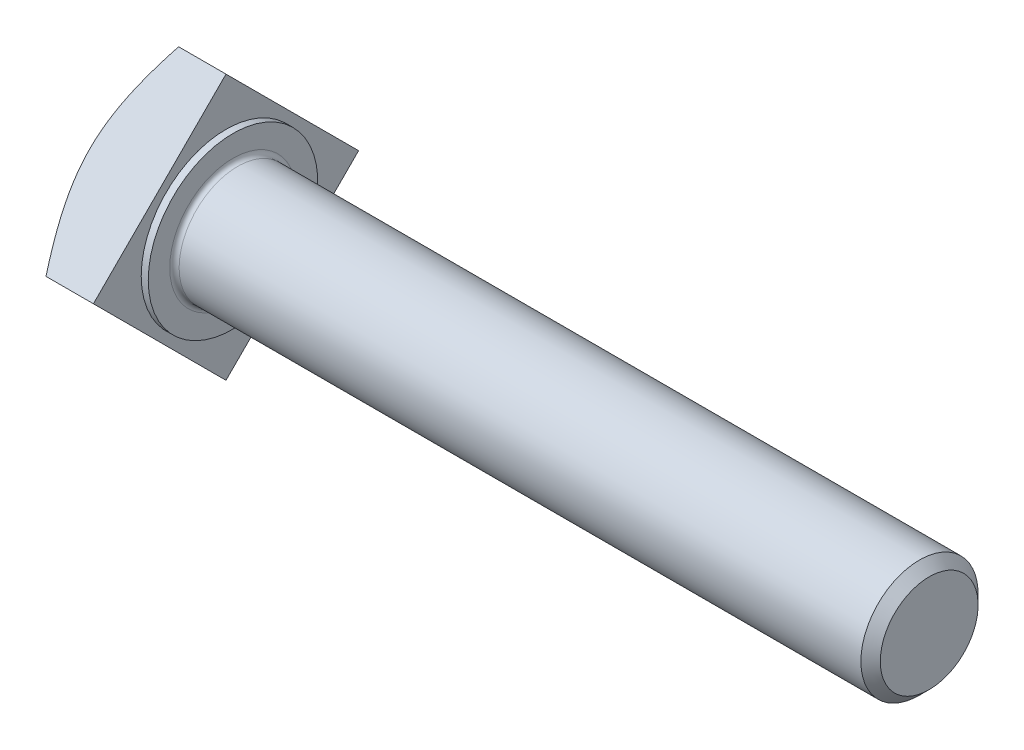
ISO-10303-21;
HEADER;
FILE_DESCRIPTION(('STEP AP214'),'2;1');
FILE_NAME('part.step','',(''),(''),'','','');
FILE_SCHEMA(('AUTOMOTIVE_DESIGN { 1 0 10303 214 1 1 1 1 }'));
ENDSEC;
DATA;
#1=APPLICATION_CONTEXT('core data for automotive mechanical design processes');
#2=APPLICATION_PROTOCOL_DEFINITION('international standard','automotive_design',2000,#1);
#3=PRODUCT_CONTEXT('',#1,'mechanical');
#4=PRODUCT('Part','Part','',(#3));
#5=PRODUCT_RELATED_PRODUCT_CATEGORY('part','',(#4));
#6=PRODUCT_DEFINITION_FORMATION('','',#4);
#7=PRODUCT_DEFINITION_CONTEXT('part definition',#1,'design');
#8=PRODUCT_DEFINITION('design','',#6,#7);
#9=PRODUCT_DEFINITION_SHAPE('','',#8);
#10=(LENGTH_UNIT() NAMED_UNIT(*) SI_UNIT(.MILLI.,.METRE.));
#11=(NAMED_UNIT(*) PLANE_ANGLE_UNIT() SI_UNIT($,.RADIAN.));
#12=(NAMED_UNIT(*) SI_UNIT($,.STERADIAN.) SOLID_ANGLE_UNIT());
#13=UNCERTAINTY_MEASURE_WITH_UNIT(LENGTH_MEASURE(1.E-05),#10,'distance_accuracy_value','');
#14=(GEOMETRIC_REPRESENTATION_CONTEXT(3) GLOBAL_UNCERTAINTY_ASSIGNED_CONTEXT((#13)) GLOBAL_UNIT_ASSIGNED_CONTEXT((#10,
#11,#12)) REPRESENTATION_CONTEXT('',''));
#15=CARTESIAN_POINT('',(0.,0.,0.));
#16=DIRECTION('',(0.,0.,1.));
#17=DIRECTION('',(1.,0.,0.));
#18=AXIS2_PLACEMENT_3D('',#15,#16,#17);
#19=CARTESIAN_POINT('',(6.4,0.,11.3137084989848));
#20=DIRECTION('',(0.,-0.707106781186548,-0.707106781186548));
#21=DIRECTION('',(0.,0.707106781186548,-0.707106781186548));
#22=AXIS2_PLACEMENT_3D('',#19,#20,#21);
#23=PLANE('',#22);
#24=CARTESIAN_POINT('',(2.35495892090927,-0.00020000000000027,11.3139084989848));
#25=CARTESIAN_POINT('',(2.24393651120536,0.192162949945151,11.1215455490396));
#26=CARTESIAN_POINT('',(2.13526682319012,0.385220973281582,10.9284875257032));
#27=CARTESIAN_POINT('',(1.92374625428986,0.772998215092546,10.5407102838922));
#28=CARTESIAN_POINT('',(1.82089740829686,0.967717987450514,10.3459905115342));
#29=CARTESIAN_POINT('',(1.62159774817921,1.36016323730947,9.95354526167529));
#30=CARTESIAN_POINT('',(1.52519032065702,1.55789984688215,9.75580865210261));
#31=CARTESIAN_POINT('',(1.34099203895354,1.95533199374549,9.35837650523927));
#32=CARTESIAN_POINT('',(1.25320045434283,2.15502736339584,9.15868113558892));
#33=CARTESIAN_POINT('',(1.00810307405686,2.75061455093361,8.56309394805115));
#34=CARTESIAN_POINT('',(0.865546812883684,3.14972873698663,8.16397976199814));
#35=CARTESIAN_POINT('',(0.693593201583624,3.75386257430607,7.5598459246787));
#36=CARTESIAN_POINT('',(0.643286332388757,3.95593629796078,7.35777220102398));
#37=CARTESIAN_POINT('',(0.558470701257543,4.36175045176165,6.95195804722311));
#38=CARTESIAN_POINT('',(0.523960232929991,4.56549069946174,6.74821779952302));
#39=CARTESIAN_POINT('',(0.476493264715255,4.94072498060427,6.37298351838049));
#40=CARTESIAN_POINT('',(0.460938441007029,5.11205554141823,6.20165295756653));
#41=CARTESIAN_POINT('',(0.442499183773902,5.45505842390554,5.85865007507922));
#42=CARTESIAN_POINT('',(0.439614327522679,5.62673073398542,5.68697776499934));
#43=CARTESIAN_POINT('',(0.446621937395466,5.97001902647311,5.34368947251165));
#44=CARTESIAN_POINT('',(0.456520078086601,6.14163495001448,5.17207354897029));
#45=CARTESIAN_POINT('',(0.488751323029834,6.48427842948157,4.82943006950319));
#46=CARTESIAN_POINT('',(0.511084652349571,6.65530597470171,4.65840252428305));
#47=CARTESIAN_POINT('',(0.567490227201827,6.99667442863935,4.31703407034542));
#48=CARTESIAN_POINT('',(0.601582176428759,7.1670136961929,4.14669480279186));
#49=CARTESIAN_POINT('',(0.680479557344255,7.50645646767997,3.80725203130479));
#50=CARTESIAN_POINT('',(0.725286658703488,7.67555977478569,3.63814872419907));
#51=CARTESIAN_POINT('',(0.874030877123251,8.18074931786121,3.13295918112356));
#52=CARTESIAN_POINT('',(0.992296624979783,8.5147472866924,2.79896121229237));
#53=CARTESIAN_POINT('',(1.20941634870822,9.05626009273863,2.25744840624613));
#54=CARTESIAN_POINT('',(1.29967273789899,9.26557235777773,2.04813614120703));
#55=CARTESIAN_POINT('',(1.48982262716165,9.68193413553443,1.63177436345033));
#56=CARTESIAN_POINT('',(1.58971323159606,9.88898430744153,1.42472419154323));
#57=CARTESIAN_POINT('',(1.79686148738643,10.3000125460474,1.01369595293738));
#58=CARTESIAN_POINT('',(1.90407852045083,10.5040009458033,0.809707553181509));
#59=CARTESIAN_POINT('',(2.12499302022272,10.9102169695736,0.403491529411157));
#60=CARTESIAN_POINT('',(2.2386904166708,11.1124446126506,0.201263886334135));
#61=CARTESIAN_POINT('',(2.35495892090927,11.3139084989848,-0.000199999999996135));
#62=B_SPLINE_CURVE_WITH_KNOTS('',3,(#24,#25,#26,#27,#28,#29,#30,#31,#32,#33,#34,#35,#36,#37,#38,
#39,#40,#41,#42,#43,#44,#45,#46,#47,#48,#49,#50,#51,#52,#53,#54,#55,#56,#57,#58,#59,#60,#61),
.UNSPECIFIED.,.F.,.F.,(4,2,2,2,2,2,2,2,2,2,2,2,2,2,2,2,2,2,4),(0.,0.881492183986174,
1.76329064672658,2.65052927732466,3.5376926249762,5.2816520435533,6.15180959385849,
7.02187312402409,7.74995274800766,8.47800807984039,9.20638671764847,9.9347785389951,
10.6643968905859,11.3941290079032,12.8534563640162,13.7817257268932,14.709716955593,
15.6329258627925,16.5561247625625),.UNSPECIFIED.);
#63=CARTESIAN_POINT('',(2.35484344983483,0.,11.3137084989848));
#64=VERTEX_POINT('',#63);
#65=CARTESIAN_POINT('',(2.35484344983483,11.3137084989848,0.));
#66=VERTEX_POINT('',#65);
#67=EDGE_CURVE('E48',#64,#66,#62,.T.);
#68=ORIENTED_EDGE('',*,*,#67,.F.);
#69=DIRECTION('',(-1.,0.,0.));
#70=VECTOR('',#69,1.);
#71=CARTESIAN_POINT('',(6.4,0.,11.3137084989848));
#72=LINE('',#71,#70);
#73=CARTESIAN_POINT('',(6.4,0.,11.3137084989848));
#74=VERTEX_POINT('',#73);
#75=EDGE_CURVE('E86',#74,#64,#72,.T.);
#76=ORIENTED_EDGE('',*,*,#75,.F.);
#77=DIRECTION('',(0.,-0.707106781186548,0.707106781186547));
#78=VECTOR('',#77,1.);
#79=CARTESIAN_POINT('',(6.4,0.,11.3137084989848));
#80=LINE('',#79,#78);
#81=CARTESIAN_POINT('',(6.4,11.3137084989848,0.));
#82=VERTEX_POINT('',#81);
#83=EDGE_CURVE('E105',#82,#74,#80,.T.);
#84=ORIENTED_EDGE('',*,*,#83,.F.);
#85=DIRECTION('',(-1.,0.,0.));
#86=VECTOR('',#85,1.);
#87=CARTESIAN_POINT('',(6.4,11.3137084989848,0.));
#88=LINE('',#87,#86);
#89=EDGE_CURVE('E87',#82,#66,#88,.T.);
#90=ORIENTED_EDGE('',*,*,#89,.T.);
#91=EDGE_LOOP('',(#68,#76,#84,#90));
#92=FACE_BOUND('',#91,.T.);
#93=ADVANCED_FACE('F33',(#92),#23,.F.);
#94=CARTESIAN_POINT('',(6.4,-11.3137084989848,0.));
#95=DIRECTION('',(0.,0.707106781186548,-0.707106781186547));
#96=DIRECTION('',(0.,0.707106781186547,0.707106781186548));
#97=AXIS2_PLACEMENT_3D('',#94,#95,#96);
#98=PLANE('',#97);
#99=CARTESIAN_POINT('',(2.35495892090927,-11.3139084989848,-0.000200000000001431));
#100=CARTESIAN_POINT('',(2.24393651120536,-11.1215455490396,0.19216294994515));
#101=CARTESIAN_POINT('',(2.13526682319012,-10.9284875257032,0.385220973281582));
#102=CARTESIAN_POINT('',(1.92374625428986,-10.5407102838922,0.772998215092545));
#103=CARTESIAN_POINT('',(1.82089740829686,-10.3459905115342,0.967717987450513));
#104=CARTESIAN_POINT('',(1.62159774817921,-9.95354526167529,1.36016323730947));
#105=CARTESIAN_POINT('',(1.52519032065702,-9.75580865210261,1.55789984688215));
#106=CARTESIAN_POINT('',(1.34099203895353,-9.35837650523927,1.95533199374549));
#107=CARTESIAN_POINT('',(1.25320045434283,-9.15868113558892,2.15502736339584));
#108=CARTESIAN_POINT('',(1.00810307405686,-8.56309394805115,2.75061455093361));
#109=CARTESIAN_POINT('',(0.865546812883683,-8.16397976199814,3.14972873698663));
#110=CARTESIAN_POINT('',(0.693593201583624,-7.5598459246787,3.75386257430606));
#111=CARTESIAN_POINT('',(0.643286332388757,-7.35777220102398,3.95593629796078));
#112=CARTESIAN_POINT('',(0.558470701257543,-6.95195804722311,4.36175045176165));
#113=CARTESIAN_POINT('',(0.523960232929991,-6.74821779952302,4.56549069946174));
#114=CARTESIAN_POINT('',(0.476493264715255,-6.37298351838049,4.94072498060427));
#115=CARTESIAN_POINT('',(0.460938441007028,-6.20165295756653,5.11205554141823));
#116=CARTESIAN_POINT('',(0.4424991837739,-5.85865007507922,5.45505842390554));
#117=CARTESIAN_POINT('',(0.439614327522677,-5.68697776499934,5.62673073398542));
#118=CARTESIAN_POINT('',(0.446621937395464,-5.34368947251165,5.97001902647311));
#119=CARTESIAN_POINT('',(0.4565200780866,-5.17207354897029,6.14163495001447));
#120=CARTESIAN_POINT('',(0.488751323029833,-4.82943006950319,6.48427842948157));
#121=CARTESIAN_POINT('',(0.51108465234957,-4.65840252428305,6.65530597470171));
#122=CARTESIAN_POINT('',(0.567490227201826,-4.31703407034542,6.99667442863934));
#123=CARTESIAN_POINT('',(0.601582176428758,-4.14669480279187,7.1670136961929));
#124=CARTESIAN_POINT('',(0.680479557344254,-3.80725203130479,7.50645646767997));
#125=CARTESIAN_POINT('',(0.725286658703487,-3.63814872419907,7.67555977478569));
#126=CARTESIAN_POINT('',(0.874030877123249,-3.13295918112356,8.1807493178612));
#127=CARTESIAN_POINT('',(0.992296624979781,-2.79896121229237,8.51474728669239));
#128=CARTESIAN_POINT('',(1.20941634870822,-2.25744840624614,9.05626009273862));
#129=CARTESIAN_POINT('',(1.29967273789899,-2.04813614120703,9.26557235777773));
#130=CARTESIAN_POINT('',(1.48982262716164,-1.63177436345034,9.68193413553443));
#131=CARTESIAN_POINT('',(1.58971323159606,-1.42472419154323,9.88898430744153));
#132=CARTESIAN_POINT('',(1.79686148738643,-1.01369595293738,10.3000125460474));
#133=CARTESIAN_POINT('',(1.90407852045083,-0.809707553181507,10.5040009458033));
#134=CARTESIAN_POINT('',(2.12499302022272,-0.403491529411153,10.9102169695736));
#135=CARTESIAN_POINT('',(2.2386904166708,-0.201263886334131,11.1124446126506));
#136=CARTESIAN_POINT('',(2.35495892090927,0.000200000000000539,11.3139084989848));
#137=B_SPLINE_CURVE_WITH_KNOTS('',3,(#99,#100,#101,#102,#103,#104,#105,#106,#107,#108,#109,#110,
#111,#112,#113,#114,#115,#116,#117,#118,#119,#120,#121,#122,#123,#124,#125,#126,#127,#128,#129,
#130,#131,#132,#133,#134,#135,#136),.UNSPECIFIED.,.F.,.F.,(4,2,2,2,2,2,2,2,2,2,2,2,2,2,2,2,2,2,
4),(0.,0.881492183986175,1.76329064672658,2.65052927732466,3.5376926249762,5.28165204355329,
6.15180959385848,7.02187312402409,7.74995274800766,8.47800807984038,9.20638671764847,
9.93477853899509,10.6643968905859,11.3941290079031,12.8534563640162,13.7817257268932,
14.709716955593,15.6329258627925,16.5561247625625),.UNSPECIFIED.);
#138=CARTESIAN_POINT('',(2.35484344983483,-11.3137084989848,0.));
#139=VERTEX_POINT('',#138);
#140=EDGE_CURVE('E73',#139,#64,#137,.T.);
#141=ORIENTED_EDGE('',*,*,#140,.F.);
#142=DIRECTION('',(-1.,0.,0.));
#143=VECTOR('',#142,1.);
#144=CARTESIAN_POINT('',(6.4,-11.3137084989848,0.));
#145=LINE('',#144,#143);
#146=CARTESIAN_POINT('',(6.4,-11.3137084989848,0.));
#147=VERTEX_POINT('',#146);
#148=EDGE_CURVE('E92',#147,#139,#145,.T.);
#149=ORIENTED_EDGE('',*,*,#148,.F.);
#150=DIRECTION('',(0.,-0.707106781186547,-0.707106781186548));
#151=VECTOR('',#150,1.);
#152=CARTESIAN_POINT('',(6.4,-11.3137084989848,0.));
#153=LINE('',#152,#151);
#154=EDGE_CURVE('E91',#74,#147,#153,.T.);
#155=ORIENTED_EDGE('',*,*,#154,.F.);
#156=ORIENTED_EDGE('',*,*,#75,.T.);
#157=EDGE_LOOP('',(#141,#149,#155,#156));
#158=FACE_BOUND('',#157,.T.);
#159=ADVANCED_FACE('F90',(#158),#98,.F.);
#160=CARTESIAN_POINT('',(6.4,0.,-11.3137084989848));
#161=DIRECTION('',(0.,0.707106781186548,0.707106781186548));
#162=DIRECTION('',(0.,-0.707106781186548,0.707106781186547));
#163=AXIS2_PLACEMENT_3D('',#160,#161,#162);
#164=PLANE('',#163);
#165=CARTESIAN_POINT('',(2.35495892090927,0.000200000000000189,-11.3139084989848));
#166=CARTESIAN_POINT('',(2.24393651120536,-0.192162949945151,-11.1215455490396));
#167=CARTESIAN_POINT('',(2.13526682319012,-0.385220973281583,-10.9284875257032));
#168=CARTESIAN_POINT('',(1.92374625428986,-0.772998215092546,-10.5407102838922));
#169=CARTESIAN_POINT('',(1.82089740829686,-0.967717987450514,-10.3459905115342));
#170=CARTESIAN_POINT('',(1.62159774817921,-1.36016323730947,-9.95354526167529));
#171=CARTESIAN_POINT('',(1.52519032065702,-1.55789984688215,-9.75580865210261));
#172=CARTESIAN_POINT('',(1.34099203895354,-1.95533199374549,-9.35837650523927));
#173=CARTESIAN_POINT('',(1.25320045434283,-2.15502736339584,-9.15868113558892));
#174=CARTESIAN_POINT('',(1.00810307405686,-2.75061455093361,-8.56309394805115));
#175=CARTESIAN_POINT('',(0.865546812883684,-3.14972873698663,-8.16397976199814));
#176=CARTESIAN_POINT('',(0.693593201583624,-3.75386257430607,-7.5598459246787));
#177=CARTESIAN_POINT('',(0.643286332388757,-3.95593629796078,-7.35777220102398));
#178=CARTESIAN_POINT('',(0.558470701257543,-4.36175045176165,-6.95195804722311));
#179=CARTESIAN_POINT('',(0.523960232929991,-4.56549069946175,-6.74821779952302));
#180=CARTESIAN_POINT('',(0.476493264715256,-4.94072498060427,-6.37298351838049));
#181=CARTESIAN_POINT('',(0.460938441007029,-5.11205554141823,-6.20165295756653));
#182=CARTESIAN_POINT('',(0.442499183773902,-5.45505842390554,-5.85865007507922));
#183=CARTESIAN_POINT('',(0.439614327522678,-5.62673073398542,-5.68697776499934));
#184=CARTESIAN_POINT('',(0.446621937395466,-5.97001902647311,-5.34368947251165));
#185=CARTESIAN_POINT('',(0.456520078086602,-6.14163495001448,-5.17207354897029));
#186=CARTESIAN_POINT('',(0.488751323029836,-6.48427842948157,-4.82943006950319));
#187=CARTESIAN_POINT('',(0.511084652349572,-6.65530597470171,-4.65840252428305));
#188=CARTESIAN_POINT('',(0.567490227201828,-6.99667442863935,-4.31703407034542));
#189=CARTESIAN_POINT('',(0.60158217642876,-7.1670136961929,-4.14669480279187));
#190=CARTESIAN_POINT('',(0.680479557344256,-7.50645646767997,-3.80725203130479));
#191=CARTESIAN_POINT('',(0.725286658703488,-7.67555977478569,-3.63814872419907));
#192=CARTESIAN_POINT('',(0.87403087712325,-8.18074931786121,-3.13295918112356));
#193=CARTESIAN_POINT('',(0.992296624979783,-8.5147472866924,-2.79896121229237));
#194=CARTESIAN_POINT('',(1.20941634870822,-9.05626009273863,-2.25744840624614));
#195=CARTESIAN_POINT('',(1.29967273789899,-9.26557235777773,-2.04813614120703));
#196=CARTESIAN_POINT('',(1.48982262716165,-9.68193413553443,-1.63177436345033));
#197=CARTESIAN_POINT('',(1.58971323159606,-9.88898430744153,-1.42472419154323));
#198=CARTESIAN_POINT('',(1.79686148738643,-10.3000125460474,-1.01369595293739));
#199=CARTESIAN_POINT('',(1.90407852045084,-10.5040009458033,-0.80970755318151));
#200=CARTESIAN_POINT('',(2.12499302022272,-10.9102169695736,-0.403491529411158));
#201=CARTESIAN_POINT('',(2.2386904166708,-11.1124446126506,-0.201263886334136));
#202=CARTESIAN_POINT('',(2.35495892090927,-11.3139084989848,0.000199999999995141));
#203=B_SPLINE_CURVE_WITH_KNOTS('',3,(#165,#166,#167,#168,#169,#170,#171,#172,#173,#174,#175,
#176,#177,#178,#179,#180,#181,#182,#183,#184,#185,#186,#187,#188,#189,#190,#191,#192,#193,#194,
#195,#196,#197,#198,#199,#200,#201,#202),.UNSPECIFIED.,.F.,.F.,(4,2,2,2,2,2,2,2,2,2,2,2,2,2,2,2,
2,2,4),(0.,0.881492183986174,1.76329064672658,2.65052927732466,3.5376926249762,5.2816520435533,
6.15180959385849,7.02187312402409,7.74995274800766,8.47800807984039,9.20638671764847,
9.9347785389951,10.6643968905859,11.3941290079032,12.8534563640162,13.7817257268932,
14.709716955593,15.6329258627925,16.5561247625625),.UNSPECIFIED.);
#204=CARTESIAN_POINT('',(2.35484344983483,0.,-11.3137084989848));
#205=VERTEX_POINT('',#204);
#206=EDGE_CURVE('E76',#205,#139,#203,.T.);
#207=ORIENTED_EDGE('',*,*,#206,.F.);
#208=DIRECTION('',(-1.,0.,0.));
#209=VECTOR('',#208,1.);
#210=CARTESIAN_POINT('',(6.4,0.,-11.3137084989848));
#211=LINE('',#210,#209);
#212=CARTESIAN_POINT('',(6.4,0.,-11.3137084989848));
#213=VERTEX_POINT('',#212);
#214=EDGE_CURVE('E95',#213,#205,#211,.T.);
#215=ORIENTED_EDGE('',*,*,#214,.F.);
#216=DIRECTION('',(0.,0.707106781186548,-0.707106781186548));
#217=VECTOR('',#216,1.);
#218=CARTESIAN_POINT('',(6.4,0.,-11.3137084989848));
#219=LINE('',#218,#217);
#220=EDGE_CURVE('E102',#147,#213,#219,.T.);
#221=ORIENTED_EDGE('',*,*,#220,.F.);
#222=ORIENTED_EDGE('',*,*,#148,.T.);
#223=EDGE_LOOP('',(#207,#215,#221,#222));
#224=FACE_BOUND('',#223,.T.);
#225=ADVANCED_FACE('F148',(#224),#164,.F.);
#226=CARTESIAN_POINT('',(6.4,11.3137084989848,0.));
#227=DIRECTION('',(0.,-0.707106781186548,0.707106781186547));
#228=DIRECTION('',(0.,-0.707106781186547,-0.707106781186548));
#229=AXIS2_PLACEMENT_3D('',#226,#227,#228);
#230=PLANE('',#229);
#231=CARTESIAN_POINT('',(2.35495892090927,11.3139084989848,0.000200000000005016));
#232=CARTESIAN_POINT('',(2.24393651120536,11.1215455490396,-0.192162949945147));
#233=CARTESIAN_POINT('',(2.13526682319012,10.9284875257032,-0.385220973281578));
#234=CARTESIAN_POINT('',(1.92374625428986,10.5407102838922,-0.772998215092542));
#235=CARTESIAN_POINT('',(1.82089740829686,10.3459905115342,-0.96771798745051));
#236=CARTESIAN_POINT('',(1.62159774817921,9.95354526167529,-1.36016323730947));
#237=CARTESIAN_POINT('',(1.52519032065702,9.75580865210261,-1.55789984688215));
#238=CARTESIAN_POINT('',(1.34099203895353,9.35837650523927,-1.95533199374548));
#239=CARTESIAN_POINT('',(1.25320045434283,9.15868113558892,-2.15502736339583));
#240=CARTESIAN_POINT('',(1.00810307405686,8.56309394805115,-2.75061455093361));
#241=CARTESIAN_POINT('',(0.865546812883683,8.16397976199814,-3.14972873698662));
#242=CARTESIAN_POINT('',(0.693593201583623,7.5598459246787,-3.75386257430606));
#243=CARTESIAN_POINT('',(0.643286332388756,7.35777220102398,-3.95593629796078));
#244=CARTESIAN_POINT('',(0.558470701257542,6.95195804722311,-4.36175045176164));
#245=CARTESIAN_POINT('',(0.52396023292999,6.74821779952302,-4.56549069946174));
#246=CARTESIAN_POINT('',(0.476493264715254,6.37298351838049,-4.94072498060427));
#247=CARTESIAN_POINT('',(0.460938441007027,6.20165295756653,-5.11205554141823));
#248=CARTESIAN_POINT('',(0.4424991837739,5.85865007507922,-5.45505842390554));
#249=CARTESIAN_POINT('',(0.439614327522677,5.68697776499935,-5.62673073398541));
#250=CARTESIAN_POINT('',(0.446621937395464,5.34368947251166,-5.9700190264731));
#251=CARTESIAN_POINT('',(0.456520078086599,5.17207354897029,-6.14163495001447));
#252=CARTESIAN_POINT('',(0.488751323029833,4.8294300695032,-6.48427842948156));
#253=CARTESIAN_POINT('',(0.511084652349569,4.65840252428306,-6.6553059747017));
#254=CARTESIAN_POINT('',(0.567490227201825,4.31703407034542,-6.99667442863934));
#255=CARTESIAN_POINT('',(0.601582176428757,4.14669480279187,-7.16701369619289));
#256=CARTESIAN_POINT('',(0.680479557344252,3.80725203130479,-7.50645646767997));
#257=CARTESIAN_POINT('',(0.725286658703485,3.63814872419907,-7.67555977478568));
#258=CARTESIAN_POINT('',(0.874030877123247,3.13295918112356,-8.1807493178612));
#259=CARTESIAN_POINT('',(0.992296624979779,2.79896121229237,-8.51474728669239));
#260=CARTESIAN_POINT('',(1.20941634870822,2.25744840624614,-9.05626009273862));
#261=CARTESIAN_POINT('',(1.29967273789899,2.04813614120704,-9.26557235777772));
#262=CARTESIAN_POINT('',(1.48982262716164,1.63177436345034,-9.68193413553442));
#263=CARTESIAN_POINT('',(1.58971323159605,1.42472419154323,-9.88898430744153));
#264=CARTESIAN_POINT('',(1.79686148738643,1.01369595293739,-10.3000125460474));
#265=CARTESIAN_POINT('',(1.90407852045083,0.80970755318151,-10.5040009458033));
#266=CARTESIAN_POINT('',(2.12499302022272,0.403491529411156,-10.9102169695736));
#267=CARTESIAN_POINT('',(2.2386904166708,0.201263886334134,-11.1124446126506));
#268=CARTESIAN_POINT('',(2.35495892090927,-0.000199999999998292,-11.3139084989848));
#269=B_SPLINE_CURVE_WITH_KNOTS('',3,(#231,#232,#233,#234,#235,#236,#237,#238,#239,#240,#241,
#242,#243,#244,#245,#246,#247,#248,#249,#250,#251,#252,#253,#254,#255,#256,#257,#258,#259,#260,
#261,#262,#263,#264,#265,#266,#267,#268),.UNSPECIFIED.,.F.,.F.,(4,2,2,2,2,2,2,2,2,2,2,2,2,2,2,2,
2,2,4),(0.,0.881492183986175,1.76329064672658,2.65052927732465,3.5376926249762,5.28165204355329,
6.15180959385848,7.02187312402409,7.74995274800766,8.47800807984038,9.20638671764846,
9.93477853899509,10.6643968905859,11.3941290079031,12.8534563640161,13.7817257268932,
14.709716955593,15.6329258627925,16.5561247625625),.UNSPECIFIED.);
#270=EDGE_CURVE('E137',#66,#205,#269,.T.);
#271=ORIENTED_EDGE('',*,*,#270,.F.);
#272=ORIENTED_EDGE('',*,*,#89,.F.);
#273=DIRECTION('',(0.,0.707106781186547,0.707106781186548));
#274=VECTOR('',#273,1.);
#275=CARTESIAN_POINT('',(6.4,11.3137084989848,0.));
#276=LINE('',#275,#274);
#277=EDGE_CURVE('E56',#213,#82,#276,.T.);
#278=ORIENTED_EDGE('',*,*,#277,.F.);
#279=ORIENTED_EDGE('',*,*,#214,.T.);
#280=EDGE_LOOP('',(#271,#272,#278,#279));
#281=FACE_BOUND('',#280,.T.);
#282=ADVANCED_FACE('F151',(#281),#230,.F.);
#283=CARTESIAN_POINT('',(6.4,0.,11.3137084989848));
#284=DIRECTION('',(1.,0.,0.));
#285=DIRECTION('',(0.,0.,-1.));
#286=AXIS2_PLACEMENT_3D('',#283,#284,#285);
#287=PLANE('',#286);
#288=ORIENTED_EDGE('',*,*,#83,.T.);
#289=ORIENTED_EDGE('',*,*,#154,.T.);
#290=ORIENTED_EDGE('',*,*,#220,.T.);
#291=ORIENTED_EDGE('',*,*,#277,.T.);
#292=EDGE_LOOP('',(#288,#289,#290,#291));
#293=FACE_BOUND('',#292,.T.);
#294=CARTESIAN_POINT('',(6.4,0.,0.));
#295=DIRECTION('',(-1.,0.,0.));
#296=DIRECTION('',(0.,0.,1.));
#297=AXIS2_PLACEMENT_3D('',#294,#295,#296);
#298=CIRCLE('',#297,7.235);
#299=CARTESIAN_POINT('',(6.4,0.,7.235));
#300=VERTEX_POINT('',#299);
#301=EDGE_CURVE('E107',#300,#300,#298,.T.);
#302=ORIENTED_EDGE('',*,*,#301,.T.);
#303=EDGE_LOOP('',(#302));
#304=FACE_BOUND('',#303,.T.);
#305=ADVANCED_FACE('F187',(#293,#304),#287,.T.);
#306=CARTESIAN_POINT('',(0.,0.,0.));
#307=DIRECTION('',(-1.,0.,0.));
#308=DIRECTION('',(0.,0.,1.));
#309=AXIS2_PLACEMENT_3D('',#306,#307,#308);
#310=CYLINDRICAL_SURFACE('',#309,7.235);
#311=ORIENTED_EDGE('',*,*,#301,.F.);
#312=EDGE_LOOP('',(#311));
#313=FACE_BOUND('',#312,.T.);
#314=CARTESIAN_POINT('',(7.,0.,0.));
#315=DIRECTION('',(-1.,0.,0.));
#316=DIRECTION('',(0.,0.,1.));
#317=AXIS2_PLACEMENT_3D('',#314,#315,#316);
#318=CIRCLE('',#317,7.235);
#319=CARTESIAN_POINT('',(7.,0.,7.235));
#320=VERTEX_POINT('',#319);
#321=EDGE_CURVE('E110',#320,#320,#318,.T.);
#322=ORIENTED_EDGE('',*,*,#321,.T.);
#323=EDGE_LOOP('',(#322));
#324=FACE_BOUND('',#323,.T.);
#325=ADVANCED_FACE('F239',(#313,#324),#310,.T.);
#326=CARTESIAN_POINT('',(7.,7.235,0.));
#327=DIRECTION('',(-1.,0.,0.));
#328=DIRECTION('',(0.,0.,1.));
#329=AXIS2_PLACEMENT_3D('',#326,#327,#328);
#330=PLANE('',#329);
#331=CARTESIAN_POINT('',(7.,0.,0.));
#332=DIRECTION('',(-1.,0.,0.));
#333=DIRECTION('',(0.,0.,1.));
#334=AXIS2_PLACEMENT_3D('',#331,#332,#333);
#335=CIRCLE('',#334,5.4);
#336=CARTESIAN_POINT('',(7.,0.,5.4));
#337=VERTEX_POINT('',#336);
#338=EDGE_CURVE('E41',#337,#337,#335,.T.);
#339=ORIENTED_EDGE('',*,*,#338,.T.);
#340=EDGE_LOOP('',(#339));
#341=FACE_BOUND('',#340,.T.);
#342=ORIENTED_EDGE('',*,*,#321,.F.);
#343=EDGE_LOOP('',(#342));
#344=FACE_BOUND('',#343,.T.);
#345=ADVANCED_FACE('F231',(#341,#344),#330,.F.);
#346=CARTESIAN_POINT('',(0.,0.,0.));
#347=DIRECTION('',(-1.,0.,0.));
#348=DIRECTION('',(0.,0.,1.));
#349=AXIS2_PLACEMENT_3D('',#346,#347,#348);
#350=CYLINDRICAL_SURFACE('',#349,5.);
#351=CARTESIAN_POINT('',(7.4,0.,0.));
#352=DIRECTION('',(-1.,0.,0.));
#353=DIRECTION('',(0.,0.,1.));
#354=AXIS2_PLACEMENT_3D('',#351,#352,#353);
#355=CIRCLE('',#354,5.);
#356=CARTESIAN_POINT('',(7.4,0.,5.));
#357=VERTEX_POINT('',#356);
#358=EDGE_CURVE('E11',#357,#357,#355,.F.);
#359=ORIENTED_EDGE('',*,*,#358,.T.);
#360=EDGE_LOOP('',(#359));
#361=FACE_BOUND('',#360,.T.);
#362=CARTESIAN_POINT('',(65.572,0.,0.));
#363=DIRECTION('',(-1.,0.,0.));
#364=DIRECTION('',(0.,0.,1.));
#365=AXIS2_PLACEMENT_3D('',#362,#363,#364);
#366=CIRCLE('',#365,5.);
#367=CARTESIAN_POINT('',(65.572,0.,5.));
#368=VERTEX_POINT('',#367);
#369=EDGE_CURVE('E113',#368,#368,#366,.T.);
#370=ORIENTED_EDGE('',*,*,#369,.T.);
#371=EDGE_LOOP('',(#370));
#372=FACE_BOUND('',#371,.T.);
#373=ADVANCED_FACE('F223',(#361,#372),#350,.T.);
#374=CARTESIAN_POINT('',(66.4,0.,0.));
#375=DIRECTION('',(-1.,0.,0.));
#376=DIRECTION('',(0.,0.,1.));
#377=AXIS2_PLACEMENT_3D('',#374,#375,#376);
#378=CONICAL_SURFACE('',#377,4.172,0.785398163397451);
#379=ORIENTED_EDGE('',*,*,#369,.F.);
#380=EDGE_LOOP('',(#379));
#381=FACE_BOUND('',#380,.T.);
#382=CARTESIAN_POINT('',(66.4,0.,0.));
#383=DIRECTION('',(-1.,0.,0.));
#384=DIRECTION('',(0.,0.,1.));
#385=AXIS2_PLACEMENT_3D('',#382,#383,#384);
#386=CIRCLE('',#385,4.172);
#387=CARTESIAN_POINT('',(66.4,0.,4.172));
#388=VERTEX_POINT('',#387);
#389=EDGE_CURVE('E88',#388,#388,#386,.T.);
#390=ORIENTED_EDGE('',*,*,#389,.T.);
#391=EDGE_LOOP('',(#390));
#392=FACE_BOUND('',#391,.T.);
#393=ADVANCED_FACE('F214',(#381,#392),#378,.T.);
#394=CARTESIAN_POINT('',(66.4,4.172,0.));
#395=DIRECTION('',(-1.,0.,0.));
#396=DIRECTION('',(0.,0.,1.));
#397=AXIS2_PLACEMENT_3D('',#394,#395,#396);
#398=PLANE('',#397);
#399=ORIENTED_EDGE('',*,*,#389,.F.);
#400=EDGE_LOOP('',(#399));
#401=FACE_BOUND('',#400,.T.);
#402=ADVANCED_FACE('F132',(#401),#398,.F.);
#403=CARTESIAN_POINT('',(7.4,0.,0.));
#404=DIRECTION('',(-1.,0.,0.));
#405=DIRECTION('',(0.,0.,1.));
#406=AXIS2_PLACEMENT_3D('',#403,#404,#405);
#407=TOROIDAL_SURFACE('',#406,5.4,0.4);
#408=ORIENTED_EDGE('',*,*,#358,.F.);
#409=EDGE_LOOP('',(#408));
#410=FACE_BOUND('',#409,.T.);
#411=ORIENTED_EDGE('',*,*,#338,.F.);
#412=EDGE_LOOP('',(#411));
#413=FACE_BOUND('',#412,.T.);
#414=ADVANCED_FACE('F35',(#410,#413),#407,.F.);
#415=CARTESIAN_POINT('',(0.,0.,0.));
#416=DIRECTION('',(1.,0.,0.));
#417=DIRECTION('',(0.,0.,-1.));
#418=AXIS2_PLACEMENT_3D('',#415,#416,#417);
#419=CONICAL_SURFACE('',#418,7.235,1.0471975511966);
#420=CARTESIAN_POINT('',(0.,0.,0.));
#421=DIRECTION('',(-1.,0.,0.));
#422=DIRECTION('',(0.,0.,1.));
#423=AXIS2_PLACEMENT_3D('',#420,#421,#422);
#424=CIRCLE('',#423,7.235);
#425=CARTESIAN_POINT('',(0.,0.,7.235));
#426=VERTEX_POINT('',#425);
#427=EDGE_CURVE('E269',#426,#426,#424,.T.);
#428=ORIENTED_EDGE('',*,*,#427,.F.);
#429=EDGE_LOOP('',(#428));
#430=FACE_BOUND('',#429,.T.);
#431=ORIENTED_EDGE('',*,*,#67,.T.);
#432=ORIENTED_EDGE('',*,*,#270,.T.);
#433=ORIENTED_EDGE('',*,*,#206,.T.);
#434=ORIENTED_EDGE('',*,*,#140,.T.);
#435=EDGE_LOOP('',(#431,#432,#433,#434));
#436=FACE_BOUND('',#435,.T.);
#437=ADVANCED_FACE('F74',(#430,#436),#419,.T.);
#438=CARTESIAN_POINT('',(0.,0.,11.3137084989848));
#439=DIRECTION('',(1.,0.,0.));
#440=DIRECTION('',(0.,0.,-1.));
#441=AXIS2_PLACEMENT_3D('',#438,#439,#440);
#442=PLANE('',#441);
#443=ORIENTED_EDGE('',*,*,#427,.T.);
#444=EDGE_LOOP('',(#443));
#445=FACE_BOUND('',#444,.T.);
#446=ADVANCED_FACE('F130',(#445),#442,.F.);
#447=CLOSED_SHELL('',(#93,#159,#225,#282,#305,#325,#345,#373,#393,#402,#414,#437,#446));
#448=MANIFOLD_SOLID_BREP('B2',#447);
#449=ADVANCED_BREP_SHAPE_REPRESENTATION('',(#18,#448),#14);
#450=SHAPE_DEFINITION_REPRESENTATION(#9,#449);
ENDSEC;
END-ISO-10303-21;
